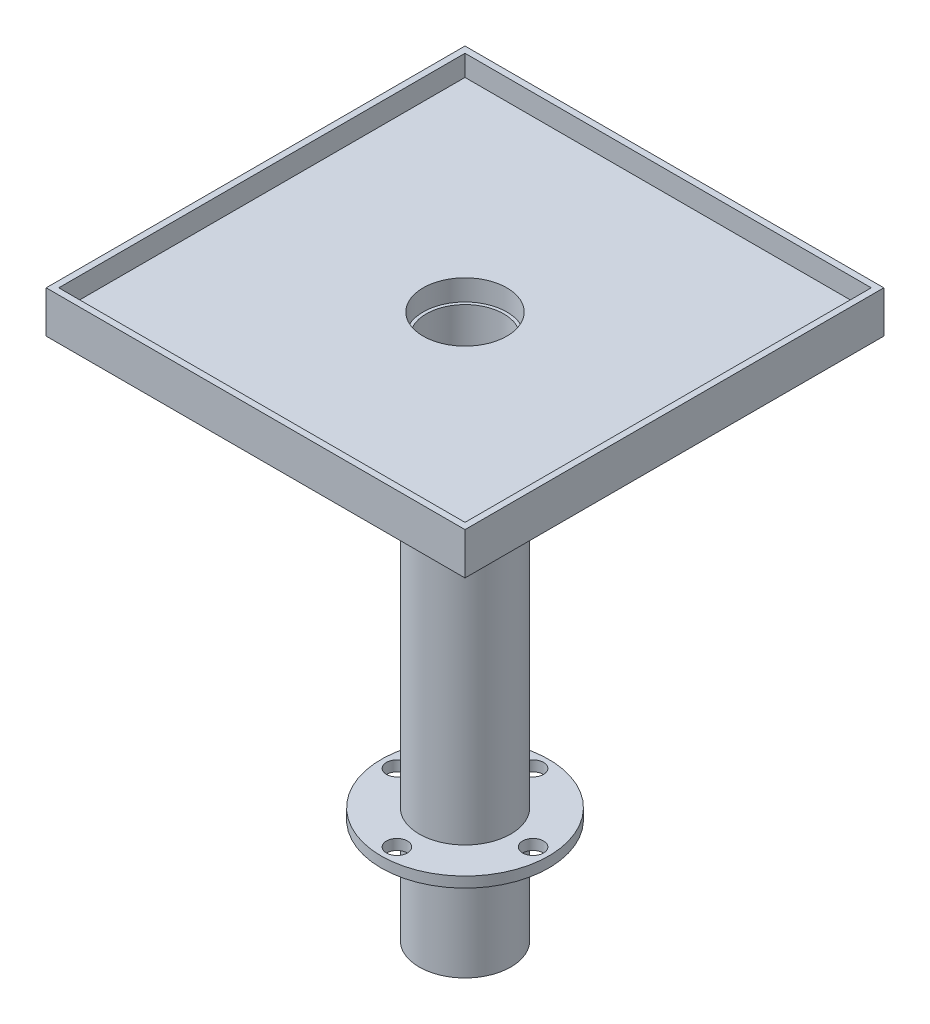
from build123d import *

# Parameters (mm, degrees)
SKETCH1_R                = 10.16
SKETCH1_R_2              = 5.08
BOSS_EXTRUDE1_DEPTH      = 1.27
BOSS_EXTRUDE2_DEPTH      = 50.8
BOSS_EXTRUDE2_DEPTH_BACK = 12.7
SKETCH2_R                = 5.551732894
SKETCH2_R_2              = 4.699
SKETCH3_W                = 50.8
SKETCH3_H                = 50.8
SKETCH3_R                = 5.08
BOSS_EXTRUDE3_DEPTH      = 2.54
SKETCH4_W                = 50.8
SKETCH4_H                = 50.8
SKETCH4_W_2              = 49.276
SKETCH4_H_2              = 49.276
BOSS_EXTRUDE4_DEPTH      = 2.54
SKETCH6_R                = 1.27
CUT_EXTRUDE1_DEPTH       = 66.364914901


with BuildPart() as part:
    # Sketch1 → Boss-Extrude1 (new body)
    with BuildSketch(Plane(origin=(0, 0, 0), x_dir=(1, 0, 0), z_dir=(0, 1, 0))):
        with Locations(Location((0, 0, 0), (0, 0, 270))):
            Circle(SKETCH1_R)
        with Locations(Location((0, 0, 0), (0, 0, 270))):
            Circle(SKETCH1_R_2, mode=Mode.SUBTRACT)
    extrude(amount=BOSS_EXTRUDE1_DEPTH)

    # Sketch2 → Boss-Extrude2 (add, two sides: drawn at the far end of the back side and taken through both)
    with BuildSketch(Plane(origin=(0, 0, 0), x_dir=(1, 0, 0), z_dir=(0, 1, 0)).offset(-BOSS_EXTRUDE2_DEPTH_BACK)):
        with Locations(Location((0, 0, 0), (0, 0, 270))):
            Circle(SKETCH2_R)
        with Locations(Location((0, 0, 0), (0, 0, 270))):
            Circle(SKETCH2_R_2, mode=Mode.SUBTRACT)
    extrude(amount=BOSS_EXTRUDE2_DEPTH + BOSS_EXTRUDE2_DEPTH_BACK)

    # Sketch3 → Boss-Extrude3 (add)
    with BuildSketch(Plane(origin=(0, 50.8, 0), x_dir=(1, 0, 0), z_dir=(0, 1, 0))):
        Rectangle(SKETCH3_W, SKETCH3_H)
        with Locations(Location((0, 0, 0), (0, 0, 270))):
            Circle(SKETCH3_R, mode=Mode.SUBTRACT)
    extrude(amount=BOSS_EXTRUDE3_DEPTH)

    # Sketch4 → Boss-Extrude4 (add)
    with BuildSketch(Plane(origin=(0, 53.34, 0), x_dir=(1, 0, 0), z_dir=(0, 1, 0))):
        Rectangle(SKETCH4_W, SKETCH4_H)
        Rectangle(SKETCH4_W_2, SKETCH4_H_2, mode=Mode.SUBTRACT)
    extrude(amount=BOSS_EXTRUDE4_DEPTH)

    # Sketch6 → Cut-Extrude1 (cut, through all)
    with BuildSketch(Plane(origin=(0, 1.27, 0), x_dir=(1, 0, 0), z_dir=(0, 1, 0))):
        with Locations(Location((0, 8.255, 0), (0, 0, 270))):
            Circle(SKETCH6_R)
        with Locations(Location((0, -8.255, 0), (0, 0, 270))):
            Circle(SKETCH6_R)
        with Locations(Location((8.255, 0, 0), (0, 0, 270))):
            Circle(SKETCH6_R)
        with Locations(Location((-8.255, 0, 0), (0, 0, 270))):
            Circle(SKETCH6_R)
    extrude(amount=-CUT_EXTRUDE1_DEPTH, mode=Mode.SUBTRACT)


solid = part.part
